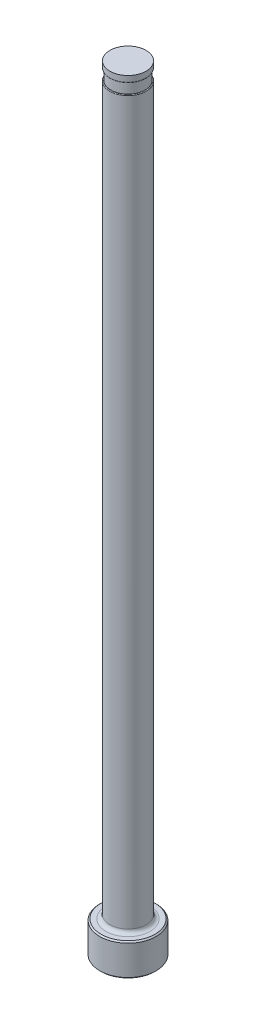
ISO-10303-21;
HEADER;
FILE_DESCRIPTION(('STEP AP214'),'2;1');
FILE_NAME('part.step','',(''),(''),'','','');
FILE_SCHEMA(('AUTOMOTIVE_DESIGN { 1 0 10303 214 1 1 1 1 }'));
ENDSEC;
DATA;
#1=APPLICATION_CONTEXT('core data for automotive mechanical design processes');
#2=APPLICATION_PROTOCOL_DEFINITION('international standard','automotive_design',2000,#1);
#3=PRODUCT_CONTEXT('',#1,'mechanical');
#4=PRODUCT('Part','Part','',(#3));
#5=PRODUCT_RELATED_PRODUCT_CATEGORY('part','',(#4));
#6=PRODUCT_DEFINITION_FORMATION('','',#4);
#7=PRODUCT_DEFINITION_CONTEXT('part definition',#1,'design');
#8=PRODUCT_DEFINITION('design','',#6,#7);
#9=PRODUCT_DEFINITION_SHAPE('','',#8);
#10=(LENGTH_UNIT() NAMED_UNIT(*) SI_UNIT(.MILLI.,.METRE.));
#11=(NAMED_UNIT(*) PLANE_ANGLE_UNIT() SI_UNIT($,.RADIAN.));
#12=(NAMED_UNIT(*) SI_UNIT($,.STERADIAN.) SOLID_ANGLE_UNIT());
#13=UNCERTAINTY_MEASURE_WITH_UNIT(LENGTH_MEASURE(1.E-05),#10,'distance_accuracy_value','');
#14=(GEOMETRIC_REPRESENTATION_CONTEXT(3) GLOBAL_UNCERTAINTY_ASSIGNED_CONTEXT((#13)) GLOBAL_UNIT_ASSIGNED_CONTEXT((#10,
#11,#12)) REPRESENTATION_CONTEXT('',''));
#15=CARTESIAN_POINT('',(0.,0.,0.));
#16=DIRECTION('',(0.,0.,1.));
#17=DIRECTION('',(1.,0.,0.));
#18=AXIS2_PLACEMENT_3D('',#15,#16,#17);
#19=CARTESIAN_POINT('',(-3.57123999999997,151.13,0.));
#20=DIRECTION('',(0.,1.,0.));
#21=DIRECTION('',(0.,0.,1.));
#22=AXIS2_PLACEMENT_3D('',#19,#20,#21);
#23=PLANE('',#22);
#24=CARTESIAN_POINT('',(0.,151.13,0.));
#25=DIRECTION('',(0.,1.,0.));
#26=DIRECTION('',(0.,0.,1.));
#27=AXIS2_PLACEMENT_3D('',#24,#25,#26);
#28=CIRCLE('',#27,3.42518999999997);
#29=CARTESIAN_POINT('',(0.,151.13,3.42518999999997));
#30=VERTEX_POINT('',#29);
#31=EDGE_CURVE('E11',#30,#30,#28,.F.);
#32=ORIENTED_EDGE('',*,*,#31,.T.);
#33=EDGE_LOOP('',(#32));
#34=FACE_BOUND('',#33,.T.);
#35=CARTESIAN_POINT('',(0.,151.13,0.));
#36=DIRECTION('',(0.,1.,0.));
#37=DIRECTION('',(0.,0.,1.));
#38=AXIS2_PLACEMENT_3D('',#35,#36,#37);
#39=CIRCLE('',#38,3.36803999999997);
#40=CARTESIAN_POINT('',(0.,151.13,3.36803999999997));
#41=VERTEX_POINT('',#40);
#42=EDGE_CURVE('E78',#41,#41,#39,.T.);
#43=ORIENTED_EDGE('',*,*,#42,.T.);
#44=EDGE_LOOP('',(#43));
#45=FACE_BOUND('',#44,.T.);
#46=ADVANCED_FACE('F36',(#34,#45),#23,.F.);
#47=CARTESIAN_POINT('',(0.,259.958771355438,0.));
#48=DIRECTION('',(0.,1.,0.));
#49=DIRECTION('',(0.,0.,1.));
#50=AXIS2_PLACEMENT_3D('',#47,#48,#49);
#51=CYLINDRICAL_SURFACE('',#50,3.57123999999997);
#52=DIRECTION('',(0.,1.,0.));
#53=VECTOR('',#52,1.);
#54=CARTESIAN_POINT('',(-3.36803999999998,259.958771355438,-1.18746018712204));
#55=LINE('',#54,#53);
#56=CARTESIAN_POINT('',(-3.36803999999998,148.971,-1.18746018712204));
#57=VERTEX_POINT('',#56);
#58=CARTESIAN_POINT('',(-3.36803999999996,86.614,-1.1874601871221));
#59=VERTEX_POINT('',#58);
#60=EDGE_CURVE('E73',#57,#59,#55,.F.);
#61=ORIENTED_EDGE('',*,*,#60,.F.);
#62=CARTESIAN_POINT('',(0.,148.971,0.));
#63=DIRECTION('',(0.,-1.,0.));
#64=DIRECTION('',(0.,0.,-1.));
#65=AXIS2_PLACEMENT_3D('',#62,#63,#64);
#66=CIRCLE('',#65,3.57123999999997);
#67=CARTESIAN_POINT('',(-3.36803999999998,148.971,1.18746018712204));
#68=VERTEX_POINT('',#67);
#69=EDGE_CURVE('E51',#57,#68,#66,.T.);
#70=ORIENTED_EDGE('',*,*,#69,.T.);
#71=DIRECTION('',(0.,1.,0.));
#72=VECTOR('',#71,1.);
#73=CARTESIAN_POINT('',(-3.36803999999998,259.958771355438,1.18746018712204));
#74=LINE('',#73,#72);
#75=CARTESIAN_POINT('',(-3.36803999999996,86.614,1.18746018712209));
#76=VERTEX_POINT('',#75);
#77=EDGE_CURVE('E84',#76,#68,#74,.T.);
#78=ORIENTED_EDGE('',*,*,#77,.F.);
#79=CARTESIAN_POINT('',(-3.36803999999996,86.614,-1.1874601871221));
#80=CARTESIAN_POINT('',(-3.3680377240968,86.5836283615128,-1.18745959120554));
#81=CARTESIAN_POINT('',(-3.36847634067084,86.55327189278,-1.18622334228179));
#82=CARTESIAN_POINT('',(-3.37021067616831,86.4927876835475,-1.18128966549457));
#83=CARTESIAN_POINT('',(-3.37150629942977,86.4626599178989,-1.1775925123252));
#84=CARTESIAN_POINT('',(-3.37663245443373,86.3730705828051,-1.16285138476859));
#85=CARTESIAN_POINT('',(-3.38170254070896,86.3142347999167,-1.14815759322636));
#86=CARTESIAN_POINT('',(-3.39461112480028,86.2000784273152,-1.10940606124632));
#87=CARTESIAN_POINT('',(-3.40245035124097,86.1447587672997,-1.08534585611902));
#88=CARTESIAN_POINT('',(-3.42005737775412,86.0391328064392,-1.02851526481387));
#89=CARTESIAN_POINT('',(-3.42982508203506,85.9888262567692,-0.995745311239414));
#90=CARTESIAN_POINT('',(-3.45028756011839,85.8943803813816,-0.922345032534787));
#91=CARTESIAN_POINT('',(-3.4609842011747,85.8502539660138,-0.881698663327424));
#92=CARTESIAN_POINT('',(-3.482209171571,85.7691926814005,-0.793737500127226));
#93=CARTESIAN_POINT('',(-3.49273745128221,85.7322598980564,-0.746420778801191));
#94=CARTESIAN_POINT('',(-3.51307583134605,85.6646585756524,-0.644120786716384));
#95=CARTESIAN_POINT('',(-3.52283072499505,85.6343557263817,-0.588885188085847));
#96=CARTESIAN_POINT('',(-3.54010786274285,85.5826078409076,-0.474091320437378));
#97=CARTESIAN_POINT('',(-3.54762954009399,85.5611650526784,-0.414531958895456));
#98=CARTESIAN_POINT('',(-3.56012114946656,85.5262555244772,-0.288969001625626));
#99=CARTESIAN_POINT('',(-3.56491124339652,85.5133434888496,-0.222793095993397));
#100=CARTESIAN_POINT('',(-3.57075657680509,85.497655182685,-0.0890807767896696));
#101=CARTESIAN_POINT('',(-3.57181063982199,85.494882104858,-0.0215439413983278));
#102=CARTESIAN_POINT('',(-3.57004535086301,85.4995778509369,0.115996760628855));
#103=CARTESIAN_POINT('',(-3.56706025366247,85.507484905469,0.185984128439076));
#104=CARTESIAN_POINT('',(-3.55722219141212,85.5343152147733,0.323545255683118));
#105=CARTESIAN_POINT('',(-3.55036911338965,85.5532387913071,0.391118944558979));
#106=CARTESIAN_POINT('',(-3.53356592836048,85.6018994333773,0.521506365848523));
#107=CARTESIAN_POINT('',(-3.52363012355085,85.6315866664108,0.584340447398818));
#108=CARTESIAN_POINT('',(-3.50178692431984,85.701455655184,0.703501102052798));
#109=CARTESIAN_POINT('',(-3.4898802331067,85.7416336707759,0.759829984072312));
#110=CARTESIAN_POINT('',(-3.46618365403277,85.8294388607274,0.861343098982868));
#111=CARTESIAN_POINT('',(-3.45441819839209,85.8765877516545,0.906946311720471));
#112=CARTESIAN_POINT('',(-3.4318469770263,85.9785334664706,0.988936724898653));
#113=CARTESIAN_POINT('',(-3.42104103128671,86.0333288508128,1.02532565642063));
#114=CARTESIAN_POINT('',(-3.40231953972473,86.1454535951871,1.08578170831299));
#115=CARTESIAN_POINT('',(-3.3942694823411,86.2024337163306,1.11045708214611));
#116=CARTESIAN_POINT('',(-3.38112795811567,86.3200270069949,1.14985485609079));
#117=CARTESIAN_POINT('',(-3.37603276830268,86.3806354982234,1.16458978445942));
#118=CARTESIAN_POINT('',(-3.37115526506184,86.4705050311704,1.17859463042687));
#119=CARTESIAN_POINT('',(-3.36998926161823,86.4991157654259,1.18192009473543));
#120=CARTESIAN_POINT('',(-3.36843159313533,86.556479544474,1.18635035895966));
#121=CARTESIAN_POINT('',(-3.36803858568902,86.5852322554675,1.18745900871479));
#122=CARTESIAN_POINT('',(-3.36803999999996,86.614,1.1874601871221));
#123=B_SPLINE_CURVE_WITH_KNOTS('',3,(#79,#80,#81,#82,#83,#84,#85,#86,#87,#88,#89,#90,#91,#92,
#93,#94,#95,#96,#97,#98,#99,#100,#101,#102,#103,#104,#105,#106,#107,#108,#109,#110,#111,#112,
#113,#114,#115,#116,#117,#118,#119,#120,#121,#122),.UNSPECIFIED.,.F.,.F.,(4,2,2,2,2,2,2,2,2,2,2,
2,2,2,2,2,2,2,2,2,2,4),(0.,0.0910565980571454,0.182103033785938,0.363698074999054,
0.545340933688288,0.726974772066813,0.908982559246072,1.09104304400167,1.28146671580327,
1.47193867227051,1.67381993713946,1.87576476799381,2.08625256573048,2.29674651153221,
2.50627812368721,2.71573513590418,2.91462117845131,3.1134698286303,3.30038893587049,
3.48707202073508,3.57347157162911,3.65972094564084),.UNSPECIFIED.);
#124=EDGE_CURVE('E81',#59,#76,#123,.T.);
#125=ORIENTED_EDGE('',*,*,#124,.F.);
#126=EDGE_LOOP('',(#61,#70,#78,#125));
#127=FACE_BOUND('',#126,.T.);
#128=CARTESIAN_POINT('',(0.,7.11200000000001,0.));
#129=DIRECTION('',(0.,1.,0.));
#130=DIRECTION('',(0.,0.,1.));
#131=AXIS2_PLACEMENT_3D('',#128,#129,#130);
#132=CIRCLE('',#131,3.57123999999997);
#133=CARTESIAN_POINT('',(0.,7.11200000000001,3.57123999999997));
#134=VERTEX_POINT('',#133);
#135=EDGE_CURVE('E116',#134,#134,#132,.T.);
#136=ORIENTED_EDGE('',*,*,#135,.T.);
#137=EDGE_LOOP('',(#136));
#138=FACE_BOUND('',#137,.T.);
#139=ADVANCED_FACE('F82',(#127,#138),#51,.T.);
#140=CARTESIAN_POINT('',(0.,0.,0.));
#141=DIRECTION('',(0.,-1.,0.));
#142=DIRECTION('',(0.,0.,-1.));
#143=AXIS2_PLACEMENT_3D('',#140,#141,#142);
#144=PLANE('',#143);
#145=CARTESIAN_POINT('',(0.,0.,0.));
#146=DIRECTION('',(0.,-1.,0.));
#147=DIRECTION('',(0.,0.,-1.));
#148=AXIS2_PLACEMENT_3D('',#145,#146,#147);
#149=CIRCLE('',#148,5.29589999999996);
#150=CARTESIAN_POINT('',(0.,0.,-5.29589999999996));
#151=VERTEX_POINT('',#150);
#152=EDGE_CURVE('E113',#151,#151,#149,.T.);
#153=ORIENTED_EDGE('',*,*,#152,.T.);
#154=EDGE_LOOP('',(#153));
#155=FACE_BOUND('',#154,.T.);
#156=ADVANCED_FACE('F192',(#155),#144,.T.);
#157=CARTESIAN_POINT('',(0.,259.958771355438,0.));
#158=DIRECTION('',(0.,1.,0.));
#159=DIRECTION('',(0.,0.,1.));
#160=AXIS2_PLACEMENT_3D('',#157,#158,#159);
#161=CYLINDRICAL_SURFACE('',#160,5.54989999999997);
#162=CARTESIAN_POINT('',(0.,6.09599999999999,0.));
#163=DIRECTION('',(0.,1.,0.));
#164=DIRECTION('',(0.,0.,1.));
#165=AXIS2_PLACEMENT_3D('',#162,#163,#164);
#166=CIRCLE('',#165,5.54989999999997);
#167=CARTESIAN_POINT('',(0.,6.09599999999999,5.54989999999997));
#168=VERTEX_POINT('',#167);
#169=EDGE_CURVE('E110',#168,#168,#166,.F.);
#170=ORIENTED_EDGE('',*,*,#169,.T.);
#171=EDGE_LOOP('',(#170));
#172=FACE_BOUND('',#171,.T.);
#173=CARTESIAN_POINT('',(0.,0.253999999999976,0.));
#174=DIRECTION('',(0.,-1.,0.));
#175=DIRECTION('',(0.,0.,-1.));
#176=AXIS2_PLACEMENT_3D('',#173,#174,#175);
#177=CIRCLE('',#176,5.54989999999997);
#178=CARTESIAN_POINT('',(0.,0.253999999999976,-5.54989999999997));
#179=VERTEX_POINT('',#178);
#180=EDGE_CURVE('E107',#179,#179,#177,.F.);
#181=ORIENTED_EDGE('',*,*,#180,.T.);
#182=EDGE_LOOP('',(#181));
#183=FACE_BOUND('',#182,.T.);
#184=ADVANCED_FACE('F195',(#172,#183),#161,.T.);
#185=CARTESIAN_POINT('',(-5.54989999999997,6.35,0.));
#186=DIRECTION('',(0.,1.,0.));
#187=DIRECTION('',(0.,0.,1.));
#188=AXIS2_PLACEMENT_3D('',#185,#186,#187);
#189=PLANE('',#188);
#190=CARTESIAN_POINT('',(0.,6.35,0.));
#191=DIRECTION('',(0.,1.,0.));
#192=DIRECTION('',(0.,0.,1.));
#193=AXIS2_PLACEMENT_3D('',#190,#191,#192);
#194=CIRCLE('',#193,4.33323999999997);
#195=CARTESIAN_POINT('',(0.,6.35,4.33323999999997));
#196=VERTEX_POINT('',#195);
#197=EDGE_CURVE('E87',#196,#196,#194,.F.);
#198=ORIENTED_EDGE('',*,*,#197,.T.);
#199=EDGE_LOOP('',(#198));
#200=FACE_BOUND('',#199,.T.);
#201=CARTESIAN_POINT('',(0.,6.35,0.));
#202=DIRECTION('',(0.,1.,0.));
#203=DIRECTION('',(0.,0.,1.));
#204=AXIS2_PLACEMENT_3D('',#201,#202,#203);
#205=CIRCLE('',#204,5.29589999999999);
#206=CARTESIAN_POINT('',(0.,6.35,5.29589999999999));
#207=VERTEX_POINT('',#206);
#208=EDGE_CURVE('E104',#207,#207,#205,.T.);
#209=ORIENTED_EDGE('',*,*,#208,.T.);
#210=EDGE_LOOP('',(#209));
#211=FACE_BOUND('',#210,.T.);
#212=ADVANCED_FACE('F190',(#200,#211),#189,.T.);
#213=CARTESIAN_POINT('',(0.,6.35000000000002,0.));
#214=DIRECTION('',(0.,-1.,0.));
#215=DIRECTION('',(0.,0.,-1.));
#216=AXIS2_PLACEMENT_3D('',#213,#214,#215);
#217=CONICAL_SURFACE('',#216,5.29589999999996,0.785398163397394);
#218=ORIENTED_EDGE('',*,*,#169,.F.);
#219=EDGE_LOOP('',(#218));
#220=FACE_BOUND('',#219,.T.);
#221=ORIENTED_EDGE('',*,*,#208,.F.);
#222=EDGE_LOOP('',(#221));
#223=FACE_BOUND('',#222,.T.);
#224=ADVANCED_FACE('F186',(#220,#223),#217,.T.);
#225=CARTESIAN_POINT('',(0.,0.253999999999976,0.));
#226=DIRECTION('',(0.,1.,0.));
#227=DIRECTION('',(0.,0.,1.));
#228=AXIS2_PLACEMENT_3D('',#225,#226,#227);
#229=CONICAL_SURFACE('',#228,5.54989999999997,0.785398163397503);
#230=ORIENTED_EDGE('',*,*,#152,.F.);
#231=EDGE_LOOP('',(#230));
#232=FACE_BOUND('',#231,.T.);
#233=ORIENTED_EDGE('',*,*,#180,.F.);
#234=EDGE_LOOP('',(#233));
#235=FACE_BOUND('',#234,.T.);
#236=ADVANCED_FACE('F182',(#232,#235),#229,.T.);
#237=CARTESIAN_POINT('',(0.,7.11200000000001,0.));
#238=DIRECTION('',(0.,1.,0.));
#239=DIRECTION('',(0.,0.,1.));
#240=AXIS2_PLACEMENT_3D('',#237,#238,#239);
#241=TOROIDAL_SURFACE('',#240,4.33323999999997,0.762);
#242=ORIENTED_EDGE('',*,*,#197,.F.);
#243=EDGE_LOOP('',(#242));
#244=FACE_BOUND('',#243,.T.);
#245=ORIENTED_EDGE('',*,*,#135,.F.);
#246=EDGE_LOOP('',(#245));
#247=FACE_BOUND('',#246,.T.);
#248=ADVANCED_FACE('F147',(#244,#247),#241,.F.);
#249=CARTESIAN_POINT('',(-3.57123999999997,149.098,0.));
#250=DIRECTION('',(0.,-1.,0.));
#251=DIRECTION('',(0.,0.,-1.));
#252=AXIS2_PLACEMENT_3D('',#249,#250,#251);
#253=PLANE('',#252);
#254=DIRECTION('',(0.,0.,1.));
#255=VECTOR('',#254,1.);
#256=CARTESIAN_POINT('',(-3.36803999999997,149.098,0.));
#257=LINE('',#256,#255);
#258=CARTESIAN_POINT('',(-3.36803999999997,149.098,0.));
#259=VERTEX_POINT('',#258);
#260=CARTESIAN_POINT('',(-3.36803999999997,149.098,0.720482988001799));
#261=VERTEX_POINT('',#260);
#262=EDGE_CURVE('E90',#259,#261,#257,.T.);
#263=ORIENTED_EDGE('',*,*,#262,.T.);
#264=CARTESIAN_POINT('',(0.,149.098,0.));
#265=DIRECTION('',(0.,-1.,0.));
#266=DIRECTION('',(0.,0.,-1.));
#267=AXIS2_PLACEMENT_3D('',#264,#265,#266);
#268=CIRCLE('',#267,3.44423999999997);
#269=CARTESIAN_POINT('',(-3.36803999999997,149.098,-0.720482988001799));
#270=VERTEX_POINT('',#269);
#271=EDGE_CURVE('E86',#261,#270,#268,.F.);
#272=ORIENTED_EDGE('',*,*,#271,.T.);
#273=EDGE_CURVE('E79',#270,#259,#257,.T.);
#274=ORIENTED_EDGE('',*,*,#273,.T.);
#275=CARTESIAN_POINT('',(0.,149.098,0.));
#276=DIRECTION('',(0.,1.,0.));
#277=DIRECTION('',(0.,0.,1.));
#278=AXIS2_PLACEMENT_3D('',#275,#276,#277);
#279=CIRCLE('',#278,3.36803999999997);
#280=EDGE_CURVE('E101',#259,#259,#279,.T.);
#281=ORIENTED_EDGE('',*,*,#280,.F.);
#282=EDGE_LOOP('',(#263,#272,#274,#281));
#283=FACE_BOUND('',#282,.T.);
#284=ADVANCED_FACE('F144',(#283),#253,.F.);
#285=CARTESIAN_POINT('',(0.,153.448281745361,0.));
#286=DIRECTION('',(0.,1.,0.));
#287=DIRECTION('',(0.,0.,1.));
#288=AXIS2_PLACEMENT_3D('',#285,#286,#287);
#289=CYLINDRICAL_SURFACE('',#288,3.36803999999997);
#290=ORIENTED_EDGE('',*,*,#42,.F.);
#291=EDGE_LOOP('',(#290));
#292=FACE_BOUND('',#291,.T.);
#293=ORIENTED_EDGE('',*,*,#280,.T.);
#294=EDGE_LOOP('',(#293));
#295=FACE_BOUND('',#294,.T.);
#296=ADVANCED_FACE('F141',(#292,#295),#289,.T.);
#297=CARTESIAN_POINT('',(-3.36803999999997,150.114,-5.54989999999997));
#298=DIRECTION('',(1.,0.,0.));
#299=DIRECTION('',(0.,1.,0.));
#300=AXIS2_PLACEMENT_3D('',#297,#298,#299);
#301=PLANE('',#300);
#302=ORIENTED_EDGE('',*,*,#273,.F.);
#303=CARTESIAN_POINT('',(-3.36803999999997,149.098,-0.720482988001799));
#304=CARTESIAN_POINT('',(-3.36803999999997,149.097993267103,-0.741667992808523));
#305=CARTESIAN_POINT('',(-3.36803999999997,149.097767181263,-0.76285784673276));
#306=CARTESIAN_POINT('',(-3.36803999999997,149.09671621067,-0.80525692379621));
#307=CARTESIAN_POINT('',(-3.36803999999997,149.095890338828,-0.826466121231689));
#308=CARTESIAN_POINT('',(-3.36803999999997,149.093476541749,-0.86888093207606));
#309=CARTESIAN_POINT('',(-3.36803999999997,149.091887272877,-0.890086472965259));
#310=CARTESIAN_POINT('',(-3.36803999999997,149.087714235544,-0.932390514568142));
#311=CARTESIAN_POINT('',(-3.36803999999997,149.085131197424,-0.953489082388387));
#312=CARTESIAN_POINT('',(-3.36803999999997,149.079919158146,-0.987044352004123));
#313=CARTESIAN_POINT('',(-3.36803999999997,149.077725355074,-0.999568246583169));
#314=CARTESIAN_POINT('',(-3.36803999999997,149.072729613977,-1.02450849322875));
#315=CARTESIAN_POINT('',(-3.36803999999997,149.06992716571,-1.03692474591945));
#316=CARTESIAN_POINT('',(-3.36803999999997,149.06343040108,-1.06198397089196));
#317=CARTESIAN_POINT('',(-3.36803999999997,149.059708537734,-1.07461988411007));
#318=CARTESIAN_POINT('',(-3.36803999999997,149.051125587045,-1.09949809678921));
#319=CARTESIAN_POINT('',(-3.36803999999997,149.046266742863,-1.11174111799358));
#320=CARTESIAN_POINT('',(-3.36803999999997,149.037811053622,-1.12921604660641));
#321=CARTESIAN_POINT('',(-3.36803999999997,149.03488164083,-1.13476833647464));
#322=CARTESIAN_POINT('',(-3.36803999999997,149.028508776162,-1.14558508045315));
#323=CARTESIAN_POINT('',(-3.36803999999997,149.025064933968,-1.15084931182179));
#324=CARTESIAN_POINT('',(-3.36803999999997,149.018291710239,-1.15984658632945));
#325=CARTESIAN_POINT('',(-3.36803999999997,149.015085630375,-1.16367129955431));
#326=CARTESIAN_POINT('',(-3.36803999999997,149.008150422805,-1.17081956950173));
#327=CARTESIAN_POINT('',(-3.36803999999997,149.004422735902,-1.17414445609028));
#328=CARTESIAN_POINT('',(-3.36803999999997,148.998066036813,-1.17872666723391));
#329=CARTESIAN_POINT('',(-3.36803999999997,148.995640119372,-1.18026334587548));
#330=CARTESIAN_POINT('',(-3.36803999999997,148.990593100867,-1.18295888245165));
#331=CARTESIAN_POINT('',(-3.36803999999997,148.987972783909,-1.18411916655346));
#332=CARTESIAN_POINT('',(-3.36803999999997,148.982986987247,-1.18581641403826));
#333=CARTESIAN_POINT('',(-3.36803999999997,148.980645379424,-1.18642231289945));
#334=CARTESIAN_POINT('',(-3.36803999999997,148.975871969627,-1.18724906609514));
#335=CARTESIAN_POINT('',(-3.36803999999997,148.973439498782,-1.18746599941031));
#336=CARTESIAN_POINT('',(-3.36803999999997,148.971,-1.18746018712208));
#337=B_SPLINE_CURVE_WITH_KNOTS('',3,(#303,#304,#305,#306,#307,#308,#309,#310,#311,#312,#313,
#314,#315,#316,#317,#318,#319,#320,#321,#322,#323,#324,#325,#326,#327,#328,#329,#330,#331,#332,
#333,#334,#335,#336),.UNSPECIFIED.,.F.,.F.,(4,2,2,2,2,2,2,2,2,2,2,2,2,2,2,2,4),(0.,
0.0635614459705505,0.127227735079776,0.191006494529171,0.254738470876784,0.292871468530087,
0.331036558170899,0.370524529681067,0.409935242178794,0.428750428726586,0.447579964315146,
0.462519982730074,0.477419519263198,0.486010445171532,0.494568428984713,0.501793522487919,
0.509091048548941),.UNSPECIFIED.);
#338=EDGE_CURVE('E59',#270,#57,#337,.T.);
#339=ORIENTED_EDGE('',*,*,#338,.T.);
#340=ORIENTED_EDGE('',*,*,#60,.T.);
#341=DIRECTION('',(0.,0.,1.));
#342=VECTOR('',#341,1.);
#343=CARTESIAN_POINT('',(-3.36803999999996,86.614,-5.54989999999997));
#344=LINE('',#343,#342);
#345=EDGE_CURVE('E77',#59,#76,#344,.T.);
#346=ORIENTED_EDGE('',*,*,#345,.T.);
#347=ORIENTED_EDGE('',*,*,#77,.T.);
#348=CARTESIAN_POINT('',(-3.36803999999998,148.971,1.18746018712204));
#349=CARTESIAN_POINT('',(-3.36803999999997,148.973718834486,1.18746847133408));
#350=CARTESIAN_POINT('',(-3.36803999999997,148.976426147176,1.18719803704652));
#351=CARTESIAN_POINT('',(-3.36803999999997,148.981714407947,1.18617805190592));
#352=CARTESIAN_POINT('',(-3.36803999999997,148.984296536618,1.18543473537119));
#353=CARTESIAN_POINT('',(-3.36803999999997,148.989910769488,1.183315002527));
#354=CARTESIAN_POINT('',(-3.36803999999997,148.992900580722,1.18182891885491));
#355=CARTESIAN_POINT('',(-3.36803999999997,148.998613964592,1.17839592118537));
#356=CARTESIAN_POINT('',(-3.36803999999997,149.00133604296,1.17644660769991));
#357=CARTESIAN_POINT('',(-3.36803999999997,149.00827895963,1.17078841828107));
#358=CARTESIAN_POINT('',(-3.36803999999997,149.012257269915,1.16678561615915));
#359=CARTESIAN_POINT('',(-3.36803999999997,149.019603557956,1.15826505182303));
#360=CARTESIAN_POINT('',(-3.36803999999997,149.02297020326,1.15374619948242));
#361=CARTESIAN_POINT('',(-3.36803999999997,149.034637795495,1.13637607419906));
#362=CARTESIAN_POINT('',(-3.36803999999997,149.04146833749,1.1225589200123));
#363=CARTESIAN_POINT('',(-3.36803999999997,149.053284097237,1.09405878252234));
#364=CARTESIAN_POINT('',(-3.36803999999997,149.058244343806,1.07936692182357));
#365=CARTESIAN_POINT('',(-3.36803999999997,149.06678105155,1.04990009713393));
#366=CARTESIAN_POINT('',(-3.36803999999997,149.070383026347,1.03513257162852));
#367=CARTESIAN_POINT('',(-3.36803999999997,149.076680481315,1.00540216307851));
#368=CARTESIAN_POINT('',(-3.36803999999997,149.079375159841,0.99043911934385));
#369=CARTESIAN_POINT('',(-3.36803999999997,149.086439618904,0.945273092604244));
#370=CARTESIAN_POINT('',(-3.36803999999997,149.089761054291,0.914907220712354));
#371=CARTESIAN_POINT('',(-3.36803999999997,149.094361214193,0.857080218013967));
#372=CARTESIAN_POINT('',(-3.36803999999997,149.0958100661,0.829630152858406));
#373=CARTESIAN_POINT('',(-3.36803999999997,149.097615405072,0.774944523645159));
#374=CARTESIAN_POINT('',(-3.36803999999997,149.097981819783,0.747709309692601));
#375=CARTESIAN_POINT('',(-3.36803999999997,149.098,0.720482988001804));
#376=B_SPLINE_CURVE_WITH_KNOTS('',3,(#348,#349,#350,#351,#352,#353,#354,#355,#356,#357,#358,
#359,#360,#361,#362,#363,#364,#365,#366,#367,#368,#369,#370,#371,#372,#373,#374,#375),
.UNSPECIFIED.,.F.,.F.,(4,2,2,2,2,2,2,2,2,2,2,2,2,4),(0.,0.00812455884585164,0.0161441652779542,
0.0261041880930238,0.0361169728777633,0.0529520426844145,0.069823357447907,0.115707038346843,
0.162183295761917,0.207737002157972,0.253330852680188,0.34486973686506,0.427316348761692,
0.509004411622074),.UNSPECIFIED.);
#377=EDGE_CURVE('E172',#68,#261,#376,.T.);
#378=ORIENTED_EDGE('',*,*,#377,.T.);
#379=ORIENTED_EDGE('',*,*,#262,.F.);
#380=EDGE_LOOP('',(#302,#339,#340,#346,#347,#378,#379));
#381=FACE_BOUND('',#380,.T.);
#382=ADVANCED_FACE('F75',(#381),#301,.F.);
#383=CARTESIAN_POINT('',(-6.54303999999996,86.614,-5.54989999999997));
#384=DIRECTION('',(0.,0.,1.));
#385=DIRECTION('',(1.,0.,0.));
#386=AXIS2_PLACEMENT_3D('',#383,#384,#385);
#387=CYLINDRICAL_SURFACE('',#386,3.175);
#388=ORIENTED_EDGE('',*,*,#345,.F.);
#389=ORIENTED_EDGE('',*,*,#124,.T.);
#390=EDGE_LOOP('',(#388,#389));
#391=FACE_BOUND('',#390,.T.);
#392=ADVANCED_FACE('F89',(#391),#387,.F.);
#393=CARTESIAN_POINT('',(0.,152.687735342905,0.));
#394=DIRECTION('',(0.,1.,0.));
#395=DIRECTION('',(0.,0.,1.));
#396=AXIS2_PLACEMENT_3D('',#393,#394,#395);
#397=CYLINDRICAL_SURFACE('',#396,3.55218999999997);
#398=CARTESIAN_POINT('',(0.,151.257,0.));
#399=DIRECTION('',(0.,1.,0.));
#400=DIRECTION('',(0.,0.,1.));
#401=AXIS2_PLACEMENT_3D('',#398,#399,#400);
#402=CIRCLE('',#401,3.55218999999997);
#403=CARTESIAN_POINT('',(0.,151.257,3.55218999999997));
#404=VERTEX_POINT('',#403);
#405=EDGE_CURVE('E44',#404,#404,#402,.T.);
#406=ORIENTED_EDGE('',*,*,#405,.T.);
#407=EDGE_LOOP('',(#406));
#408=FACE_BOUND('',#407,.T.);
#409=CARTESIAN_POINT('',(0.,152.4,0.));
#410=DIRECTION('',(0.,1.,0.));
#411=DIRECTION('',(0.,0.,1.));
#412=AXIS2_PLACEMENT_3D('',#409,#410,#411);
#413=CIRCLE('',#412,3.55218999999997);
#414=CARTESIAN_POINT('',(0.,152.4,3.55218999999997));
#415=VERTEX_POINT('',#414);
#416=EDGE_CURVE('E91',#415,#415,#413,.T.);
#417=ORIENTED_EDGE('',*,*,#416,.F.);
#418=EDGE_LOOP('',(#417));
#419=FACE_BOUND('',#418,.T.);
#420=ADVANCED_FACE('F135',(#408,#419),#397,.T.);
#421=CARTESIAN_POINT('',(-3.57123999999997,152.4,0.));
#422=DIRECTION('',(0.,1.,0.));
#423=DIRECTION('',(0.,0.,1.));
#424=AXIS2_PLACEMENT_3D('',#421,#422,#423);
#425=PLANE('',#424);
#426=ORIENTED_EDGE('',*,*,#416,.T.);
#427=EDGE_LOOP('',(#426));
#428=FACE_BOUND('',#427,.T.);
#429=ADVANCED_FACE('F149',(#428),#425,.T.);
#430=CARTESIAN_POINT('',(0.,148.971,0.));
#431=DIRECTION('',(0.,-1.,0.));
#432=DIRECTION('',(0.,0.,-1.));
#433=AXIS2_PLACEMENT_3D('',#430,#431,#432);
#434=TOROIDAL_SURFACE('',#433,3.44423999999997,0.127);
#435=ORIENTED_EDGE('',*,*,#377,.F.);
#436=ORIENTED_EDGE('',*,*,#69,.F.);
#437=ORIENTED_EDGE('',*,*,#338,.F.);
#438=ORIENTED_EDGE('',*,*,#271,.F.);
#439=EDGE_LOOP('',(#435,#436,#437,#438));
#440=FACE_BOUND('',#439,.T.);
#441=ADVANCED_FACE('F151',(#440),#434,.T.);
#442=CARTESIAN_POINT('',(0.,151.257,0.));
#443=DIRECTION('',(0.,1.,0.));
#444=DIRECTION('',(0.,0.,1.));
#445=AXIS2_PLACEMENT_3D('',#442,#443,#444);
#446=TOROIDAL_SURFACE('',#445,3.42518999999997,0.127);
#447=ORIENTED_EDGE('',*,*,#31,.F.);
#448=EDGE_LOOP('',(#447));
#449=FACE_BOUND('',#448,.T.);
#450=ORIENTED_EDGE('',*,*,#405,.F.);
#451=EDGE_LOOP('',(#450));
#452=FACE_BOUND('',#451,.T.);
#453=ADVANCED_FACE('F38',(#449,#452),#446,.T.);
#454=CLOSED_SHELL('',(#46,#139,#156,#184,#212,#224,#236,#248,#284,#296,#382,#392,#420,#429,#441,#453));
#455=MANIFOLD_SOLID_BREP('B2',#454);
#456=ADVANCED_BREP_SHAPE_REPRESENTATION('',(#18,#455),#14);
#457=SHAPE_DEFINITION_REPRESENTATION(#9,#456);
ENDSEC;
END-ISO-10303-21;
